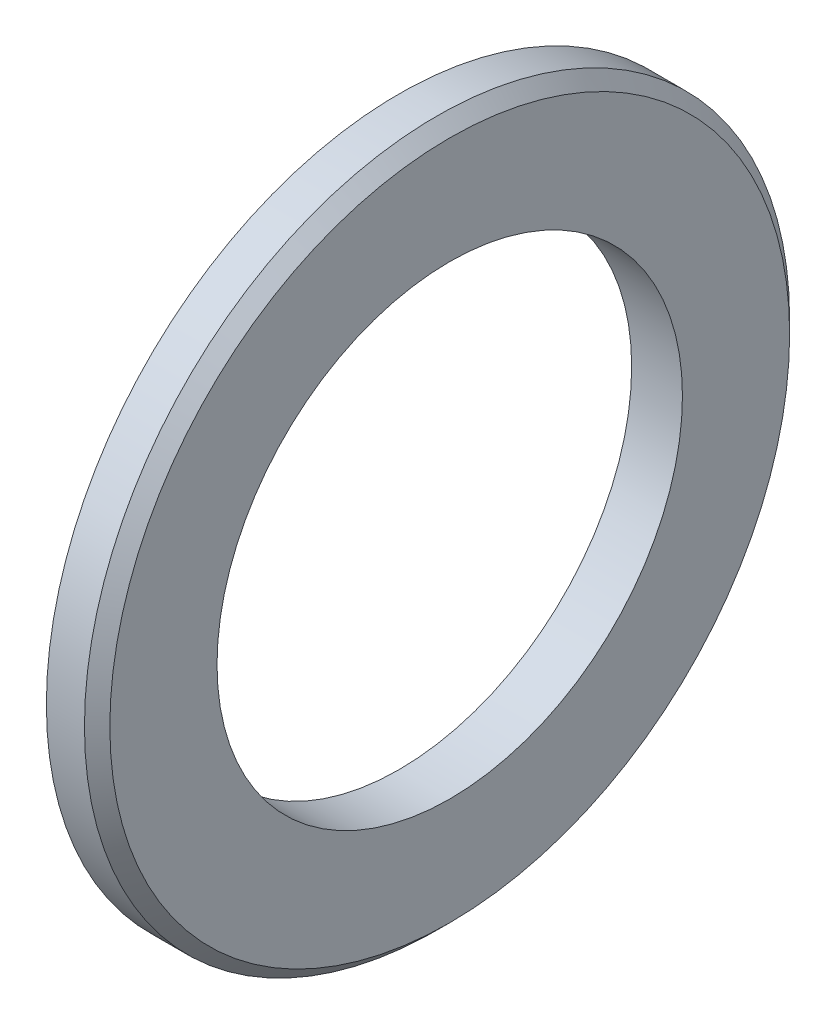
ISO-10303-21;
HEADER;
FILE_DESCRIPTION(('STEP AP214'),'2;1');
FILE_NAME('part.step','',(''),(''),'','','');
FILE_SCHEMA(('AUTOMOTIVE_DESIGN { 1 0 10303 214 1 1 1 1 }'));
ENDSEC;
DATA;
#1=APPLICATION_CONTEXT('core data for automotive mechanical design processes');
#2=APPLICATION_PROTOCOL_DEFINITION('international standard','automotive_design',2000,#1);
#3=PRODUCT_CONTEXT('',#1,'mechanical');
#4=PRODUCT('Part','Part','',(#3));
#5=PRODUCT_RELATED_PRODUCT_CATEGORY('part','',(#4));
#6=PRODUCT_DEFINITION_FORMATION('','',#4);
#7=PRODUCT_DEFINITION_CONTEXT('part definition',#1,'design');
#8=PRODUCT_DEFINITION('design','',#6,#7);
#9=PRODUCT_DEFINITION_SHAPE('','',#8);
#10=(LENGTH_UNIT() NAMED_UNIT(*) SI_UNIT(.MILLI.,.METRE.));
#11=(NAMED_UNIT(*) PLANE_ANGLE_UNIT() SI_UNIT($,.RADIAN.));
#12=(NAMED_UNIT(*) SI_UNIT($,.STERADIAN.) SOLID_ANGLE_UNIT());
#13=UNCERTAINTY_MEASURE_WITH_UNIT(LENGTH_MEASURE(1.E-05),#10,'distance_accuracy_value','');
#14=(GEOMETRIC_REPRESENTATION_CONTEXT(3) GLOBAL_UNCERTAINTY_ASSIGNED_CONTEXT((#13)) GLOBAL_UNIT_ASSIGNED_CONTEXT((#10,
#11,#12)) REPRESENTATION_CONTEXT('',''));
#15=CARTESIAN_POINT('',(0.,0.,0.));
#16=DIRECTION('',(0.,0.,1.));
#17=DIRECTION('',(1.,0.,0.));
#18=AXIS2_PLACEMENT_3D('',#15,#16,#17);
#19=CARTESIAN_POINT('',(-34.9249999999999,0.,0.));
#20=DIRECTION('',(-1.,0.,0.));
#21=DIRECTION('',(0.,0.,1.));
#22=AXIS2_PLACEMENT_3D('',#19,#20,#21);
#23=CYLINDRICAL_SURFACE('',#22,82.5);
#24=CARTESIAN_POINT('',(0.,0.,0.));
#25=DIRECTION('',(-1.,0.,0.));
#26=DIRECTION('',(0.,0.,1.));
#27=AXIS2_PLACEMENT_3D('',#24,#25,#26);
#28=CIRCLE('',#27,82.5);
#29=CARTESIAN_POINT('',(0.,0.,82.5));
#30=VERTEX_POINT('',#29);
#31=EDGE_CURVE('E48',#30,#30,#28,.T.);
#32=ORIENTED_EDGE('',*,*,#31,.F.);
#33=EDGE_LOOP('',(#32));
#34=FACE_BOUND('',#33,.T.);
#35=CARTESIAN_POINT('',(-18.,0.,0.));
#36=DIRECTION('',(-1.,0.,0.));
#37=DIRECTION('',(0.,0.,1.));
#38=AXIS2_PLACEMENT_3D('',#35,#36,#37);
#39=CIRCLE('',#38,82.5);
#40=CARTESIAN_POINT('',(-18.,0.,82.5));
#41=VERTEX_POINT('',#40);
#42=EDGE_CURVE('E57',#41,#41,#39,.T.);
#43=ORIENTED_EDGE('',*,*,#42,.T.);
#44=EDGE_LOOP('',(#43));
#45=FACE_BOUND('',#44,.T.);
#46=ADVANCED_FACE('F37',(#34,#45),#23,.F.);
#47=CARTESIAN_POINT('',(0.,82.5,0.));
#48=DIRECTION('',(-1.,0.,0.));
#49=DIRECTION('',(0.,0.,1.));
#50=AXIS2_PLACEMENT_3D('',#47,#48,#49);
#51=PLANE('',#50);
#52=CARTESIAN_POINT('',(0.,0.,0.));
#53=DIRECTION('',(-1.,0.,0.));
#54=DIRECTION('',(0.,0.,1.));
#55=AXIS2_PLACEMENT_3D('',#52,#53,#54);
#56=CIRCLE('',#55,120.5);
#57=CARTESIAN_POINT('',(0.,0.,120.5));
#58=VERTEX_POINT('',#57);
#59=EDGE_CURVE('E10',#58,#58,#56,.F.);
#60=ORIENTED_EDGE('',*,*,#59,.T.);
#61=EDGE_LOOP('',(#60));
#62=FACE_BOUND('',#61,.T.);
#63=ORIENTED_EDGE('',*,*,#31,.T.);
#64=EDGE_LOOP('',(#63));
#65=FACE_BOUND('',#64,.T.);
#66=ADVANCED_FACE('F70',(#62,#65),#51,.F.);
#67=CARTESIAN_POINT('',(-34.9249999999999,0.,0.));
#68=DIRECTION('',(-1.,0.,0.));
#69=DIRECTION('',(0.,0.,1.));
#70=AXIS2_PLACEMENT_3D('',#67,#68,#69);
#71=CYLINDRICAL_SURFACE('',#70,125.);
#72=CARTESIAN_POINT('',(-4.49999999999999,0.,0.));
#73=DIRECTION('',(-1.,0.,0.));
#74=DIRECTION('',(0.,0.,1.));
#75=AXIS2_PLACEMENT_3D('',#72,#73,#74);
#76=CIRCLE('',#75,125.);
#77=CARTESIAN_POINT('',(-4.49999999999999,0.,125.));
#78=VERTEX_POINT('',#77);
#79=EDGE_CURVE('E44',#78,#78,#76,.T.);
#80=ORIENTED_EDGE('',*,*,#79,.T.);
#81=EDGE_LOOP('',(#80));
#82=FACE_BOUND('',#81,.T.);
#83=CARTESIAN_POINT('',(-18.,0.,0.));
#84=DIRECTION('',(-1.,0.,0.));
#85=DIRECTION('',(0.,0.,1.));
#86=AXIS2_PLACEMENT_3D('',#83,#84,#85);
#87=CIRCLE('',#86,125.);
#88=CARTESIAN_POINT('',(-18.,0.,125.));
#89=VERTEX_POINT('',#88);
#90=EDGE_CURVE('E52',#89,#89,#87,.T.);
#91=ORIENTED_EDGE('',*,*,#90,.F.);
#92=EDGE_LOOP('',(#91));
#93=FACE_BOUND('',#92,.T.);
#94=ADVANCED_FACE('F65',(#82,#93),#71,.T.);
#95=CARTESIAN_POINT('',(-18.,125.,0.));
#96=DIRECTION('',(1.,0.,0.));
#97=DIRECTION('',(0.,0.,-1.));
#98=AXIS2_PLACEMENT_3D('',#95,#96,#97);
#99=PLANE('',#98);
#100=ORIENTED_EDGE('',*,*,#42,.F.);
#101=EDGE_LOOP('',(#100));
#102=FACE_BOUND('',#101,.T.);
#103=ORIENTED_EDGE('',*,*,#90,.T.);
#104=EDGE_LOOP('',(#103));
#105=FACE_BOUND('',#104,.T.);
#106=ADVANCED_FACE('F62',(#102,#105),#99,.F.);
#107=CARTESIAN_POINT('',(-4.49999999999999,0.,0.));
#108=DIRECTION('',(-1.,0.,0.));
#109=DIRECTION('',(0.,0.,1.));
#110=AXIS2_PLACEMENT_3D('',#107,#108,#109);
#111=CONICAL_SURFACE('',#110,125.,0.78539816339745);
#112=ORIENTED_EDGE('',*,*,#59,.F.);
#113=EDGE_LOOP('',(#112));
#114=FACE_BOUND('',#113,.T.);
#115=ORIENTED_EDGE('',*,*,#79,.F.);
#116=EDGE_LOOP('',(#115));
#117=FACE_BOUND('',#116,.T.);
#118=ADVANCED_FACE('F39',(#114,#117),#111,.T.);
#119=CLOSED_SHELL('',(#46,#66,#94,#106,#118));
#120=MANIFOLD_SOLID_BREP('B2',#119);
#121=ADVANCED_BREP_SHAPE_REPRESENTATION('',(#18,#120),#14);
#122=SHAPE_DEFINITION_REPRESENTATION(#9,#121);
ENDSEC;
END-ISO-10303-21;
